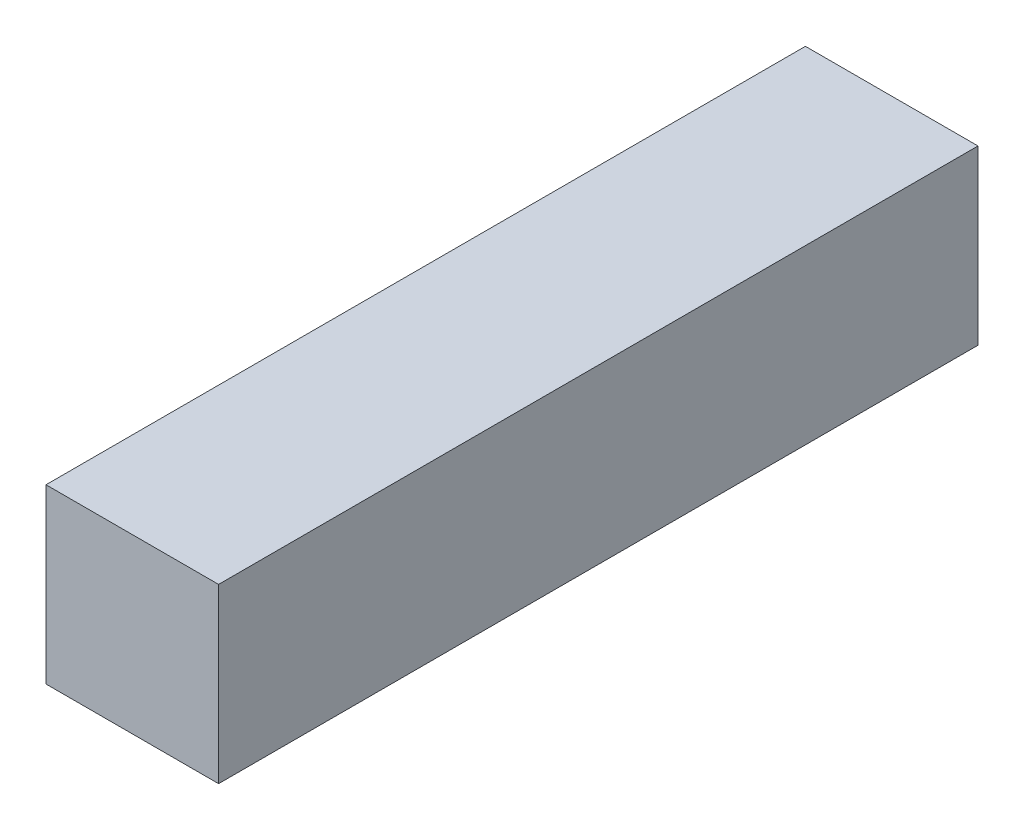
ISO-10303-21;
HEADER;
FILE_DESCRIPTION(('STEP AP214'),'2;1');
FILE_NAME('part.step','',(''),(''),'','','');
FILE_SCHEMA(('AUTOMOTIVE_DESIGN { 1 0 10303 214 1 1 1 1 }'));
ENDSEC;
DATA;
#1=APPLICATION_CONTEXT('core data for automotive mechanical design processes');
#2=APPLICATION_PROTOCOL_DEFINITION('international standard','automotive_design',2000,#1);
#3=PRODUCT_CONTEXT('',#1,'mechanical');
#4=PRODUCT('Part','Part','',(#3));
#5=PRODUCT_RELATED_PRODUCT_CATEGORY('part','',(#4));
#6=PRODUCT_DEFINITION_FORMATION('','',#4);
#7=PRODUCT_DEFINITION_CONTEXT('part definition',#1,'design');
#8=PRODUCT_DEFINITION('design','',#6,#7);
#9=PRODUCT_DEFINITION_SHAPE('','',#8);
#10=(LENGTH_UNIT() NAMED_UNIT(*) SI_UNIT(.MILLI.,.METRE.));
#11=(NAMED_UNIT(*) PLANE_ANGLE_UNIT() SI_UNIT($,.RADIAN.));
#12=(NAMED_UNIT(*) SI_UNIT($,.STERADIAN.) SOLID_ANGLE_UNIT());
#13=UNCERTAINTY_MEASURE_WITH_UNIT(LENGTH_MEASURE(1.E-05),#10,'distance_accuracy_value','');
#14=(GEOMETRIC_REPRESENTATION_CONTEXT(3) GLOBAL_UNCERTAINTY_ASSIGNED_CONTEXT((#13)) GLOBAL_UNIT_ASSIGNED_CONTEXT((#10,
#11,#12)) REPRESENTATION_CONTEXT('',''));
#15=CARTESIAN_POINT('',(0.,0.,0.));
#16=DIRECTION('',(0.,0.,1.));
#17=DIRECTION('',(1.,0.,0.));
#18=AXIS2_PLACEMENT_3D('',#15,#16,#17);
#19=CARTESIAN_POINT('',(0.,0.,44.));
#20=DIRECTION('',(1.,0.,0.));
#21=DIRECTION('',(0.,0.,-1.));
#22=AXIS2_PLACEMENT_3D('',#19,#20,#21);
#23=PLANE('',#22);
#24=DIRECTION('',(0.,-1.,0.));
#25=VECTOR('',#24,1.);
#26=CARTESIAN_POINT('',(0.,0.,0.));
#27=LINE('',#26,#25);
#28=CARTESIAN_POINT('',(0.,10.,0.));
#29=VERTEX_POINT('',#28);
#30=CARTESIAN_POINT('',(0.,0.,0.));
#31=VERTEX_POINT('',#30);
#32=EDGE_CURVE('E94',#29,#31,#27,.T.);
#33=ORIENTED_EDGE('',*,*,#32,.T.);
#34=DIRECTION('',(0.,0.,-1.));
#35=VECTOR('',#34,1.);
#36=CARTESIAN_POINT('',(0.,0.,44.));
#37=LINE('',#36,#35);
#38=CARTESIAN_POINT('',(0.,0.,44.));
#39=VERTEX_POINT('',#38);
#40=EDGE_CURVE('E11',#39,#31,#37,.T.);
#41=ORIENTED_EDGE('',*,*,#40,.F.);
#42=DIRECTION('',(0.,-1.,0.));
#43=VECTOR('',#42,1.);
#44=CARTESIAN_POINT('',(0.,0.,44.));
#45=LINE('',#44,#43);
#46=CARTESIAN_POINT('',(0.,10.,44.));
#47=VERTEX_POINT('',#46);
#48=EDGE_CURVE('E82',#47,#39,#45,.T.);
#49=ORIENTED_EDGE('',*,*,#48,.F.);
#50=DIRECTION('',(0.,0.,-1.));
#51=VECTOR('',#50,1.);
#52=CARTESIAN_POINT('',(0.,10.,44.));
#53=LINE('',#52,#51);
#54=EDGE_CURVE('E90',#47,#29,#53,.T.);
#55=ORIENTED_EDGE('',*,*,#54,.T.);
#56=EDGE_LOOP('',(#33,#41,#49,#55));
#57=FACE_BOUND('',#56,.T.);
#58=ADVANCED_FACE('F31',(#57),#23,.F.);
#59=CARTESIAN_POINT('',(0.,0.,44.));
#60=DIRECTION('',(0.,1.,0.));
#61=DIRECTION('',(0.,0.,1.));
#62=AXIS2_PLACEMENT_3D('',#59,#60,#61);
#63=PLANE('',#62);
#64=DIRECTION('',(1.,0.,0.));
#65=VECTOR('',#64,1.);
#66=CARTESIAN_POINT('',(0.,0.,0.));
#67=LINE('',#66,#65);
#68=CARTESIAN_POINT('',(10.,0.,0.));
#69=VERTEX_POINT('',#68);
#70=EDGE_CURVE('E86',#31,#69,#67,.T.);
#71=ORIENTED_EDGE('',*,*,#70,.T.);
#72=DIRECTION('',(0.,0.,-1.));
#73=VECTOR('',#72,1.);
#74=CARTESIAN_POINT('',(10.,0.,44.));
#75=LINE('',#74,#73);
#76=CARTESIAN_POINT('',(10.,0.,44.));
#77=VERTEX_POINT('',#76);
#78=EDGE_CURVE('E39',#77,#69,#75,.T.);
#79=ORIENTED_EDGE('',*,*,#78,.F.);
#80=DIRECTION('',(1.,0.,0.));
#81=VECTOR('',#80,1.);
#82=CARTESIAN_POINT('',(0.,0.,44.));
#83=LINE('',#82,#81);
#84=EDGE_CURVE('E77',#39,#77,#83,.T.);
#85=ORIENTED_EDGE('',*,*,#84,.F.);
#86=ORIENTED_EDGE('',*,*,#40,.T.);
#87=EDGE_LOOP('',(#71,#79,#85,#86));
#88=FACE_BOUND('',#87,.T.);
#89=ADVANCED_FACE('F85',(#88),#63,.F.);
#90=CARTESIAN_POINT('',(10.,0.,44.));
#91=DIRECTION('',(-1.,0.,0.));
#92=DIRECTION('',(0.,0.,1.));
#93=AXIS2_PLACEMENT_3D('',#90,#91,#92);
#94=PLANE('',#93);
#95=DIRECTION('',(0.,1.,0.));
#96=VECTOR('',#95,1.);
#97=CARTESIAN_POINT('',(10.,0.,0.));
#98=LINE('',#97,#96);
#99=CARTESIAN_POINT('',(10.,10.,0.));
#100=VERTEX_POINT('',#99);
#101=EDGE_CURVE('E64',#69,#100,#98,.T.);
#102=ORIENTED_EDGE('',*,*,#101,.T.);
#103=DIRECTION('',(0.,0.,-1.));
#104=VECTOR('',#103,1.);
#105=CARTESIAN_POINT('',(10.,10.,44.));
#106=LINE('',#105,#104);
#107=CARTESIAN_POINT('',(10.,10.,44.));
#108=VERTEX_POINT('',#107);
#109=EDGE_CURVE('E87',#108,#100,#106,.T.);
#110=ORIENTED_EDGE('',*,*,#109,.F.);
#111=DIRECTION('',(0.,1.,0.));
#112=VECTOR('',#111,1.);
#113=CARTESIAN_POINT('',(10.,0.,44.));
#114=LINE('',#113,#112);
#115=EDGE_CURVE('E80',#77,#108,#114,.T.);
#116=ORIENTED_EDGE('',*,*,#115,.F.);
#117=ORIENTED_EDGE('',*,*,#78,.T.);
#118=EDGE_LOOP('',(#102,#110,#116,#117));
#119=FACE_BOUND('',#118,.T.);
#120=ADVANCED_FACE('F88',(#119),#94,.F.);
#121=CARTESIAN_POINT('',(0.,10.,44.));
#122=DIRECTION('',(0.,-1.,0.));
#123=DIRECTION('',(0.,0.,-1.));
#124=AXIS2_PLACEMENT_3D('',#121,#122,#123);
#125=PLANE('',#124);
#126=DIRECTION('',(-1.,0.,0.));
#127=VECTOR('',#126,1.);
#128=CARTESIAN_POINT('',(0.,10.,0.));
#129=LINE('',#128,#127);
#130=EDGE_CURVE('E70',#100,#29,#129,.T.);
#131=ORIENTED_EDGE('',*,*,#130,.T.);
#132=ORIENTED_EDGE('',*,*,#54,.F.);
#133=DIRECTION('',(-1.,0.,0.));
#134=VECTOR('',#133,1.);
#135=CARTESIAN_POINT('',(0.,10.,44.));
#136=LINE('',#135,#134);
#137=EDGE_CURVE('E47',#108,#47,#136,.T.);
#138=ORIENTED_EDGE('',*,*,#137,.F.);
#139=ORIENTED_EDGE('',*,*,#109,.T.);
#140=EDGE_LOOP('',(#131,#132,#138,#139));
#141=FACE_BOUND('',#140,.T.);
#142=ADVANCED_FACE('F101',(#141),#125,.F.);
#143=CARTESIAN_POINT('',(0.,10.,44.));
#144=DIRECTION('',(0.,0.,-1.));
#145=DIRECTION('',(-1.,0.,0.));
#146=AXIS2_PLACEMENT_3D('',#143,#144,#145);
#147=PLANE('',#146);
#148=ORIENTED_EDGE('',*,*,#48,.T.);
#149=ORIENTED_EDGE('',*,*,#84,.T.);
#150=ORIENTED_EDGE('',*,*,#115,.T.);
#151=ORIENTED_EDGE('',*,*,#137,.T.);
#152=EDGE_LOOP('',(#148,#149,#150,#151));
#153=FACE_BOUND('',#152,.T.);
#154=ADVANCED_FACE('F78',(#153),#147,.F.);
#155=CARTESIAN_POINT('',(0.,10.,0.));
#156=DIRECTION('',(0.,0.,-1.));
#157=DIRECTION('',(-1.,0.,0.));
#158=AXIS2_PLACEMENT_3D('',#155,#156,#157);
#159=PLANE('',#158);
#160=ORIENTED_EDGE('',*,*,#32,.F.);
#161=ORIENTED_EDGE('',*,*,#130,.F.);
#162=ORIENTED_EDGE('',*,*,#101,.F.);
#163=ORIENTED_EDGE('',*,*,#70,.F.);
#164=EDGE_LOOP('',(#160,#161,#162,#163));
#165=FACE_BOUND('',#164,.T.);
#166=ADVANCED_FACE('F104',(#165),#159,.T.);
#167=CLOSED_SHELL('',(#58,#89,#120,#142,#154,#166));
#168=MANIFOLD_SOLID_BREP('B2',#167);
#169=ADVANCED_BREP_SHAPE_REPRESENTATION('',(#18,#168),#14);
#170=SHAPE_DEFINITION_REPRESENTATION(#9,#169);
ENDSEC;
END-ISO-10303-21;
